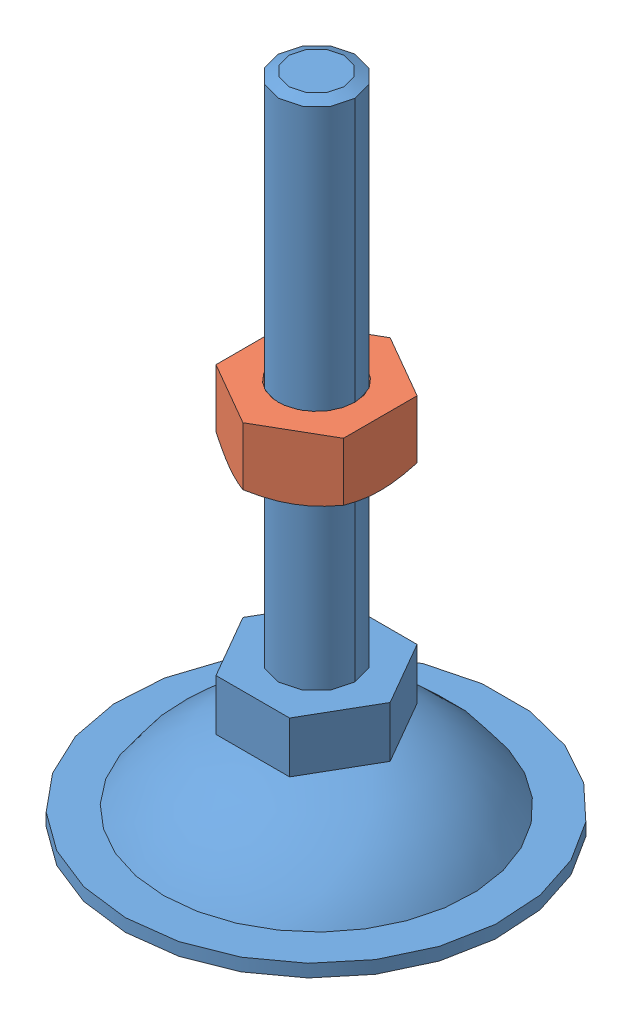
SolidWorks assembly J3LF.SLDASM, configuration Default (file format 7000). Lengths in mm.
Overall size (30 51 30).
2 component instances, 2 part files, 3 mates.
Components (placement in the parent):
- J3LF-1: J3LF.SLDPRT [Default] at (-5.5518 -28.3793 -8.2724) size (30 51 30)
- NT06-1: NT06.sldprt [Default] at (-5.5518 -3.3793 -8.2724) x (1 0 0) z (0 -1 0) size (10 11.55 5)
Mates (geometry in assembly coordinates):
- 同心1: concentric anti-aligned: cylinder of J3LF-1 through (-5.5518 22.6207 -8.2724) axis (0 1 0) radius 3; cylinder of NT06-1 through (-5.5518 1.6207 -8.2724) axis (0 -1 0) radius 2.5
- 距离1: distance = 30 mm anti-aligned: plane of J3LF-1 through (-5.5518 -28.3793 -8.2724) normal (0 -1 0); plane of NT06-1 through (-5.5518 1.6207 -2.4989) normal (0 1 0)
- 距離1: distance = 40 mm: plane of NT06-1 through (-5.5518 11.6207 -2.4989) normal (0 1 0); plane of J3LF-1 through (-5.5518 -28.3793 -8.2724) normal (0 -1 0)
